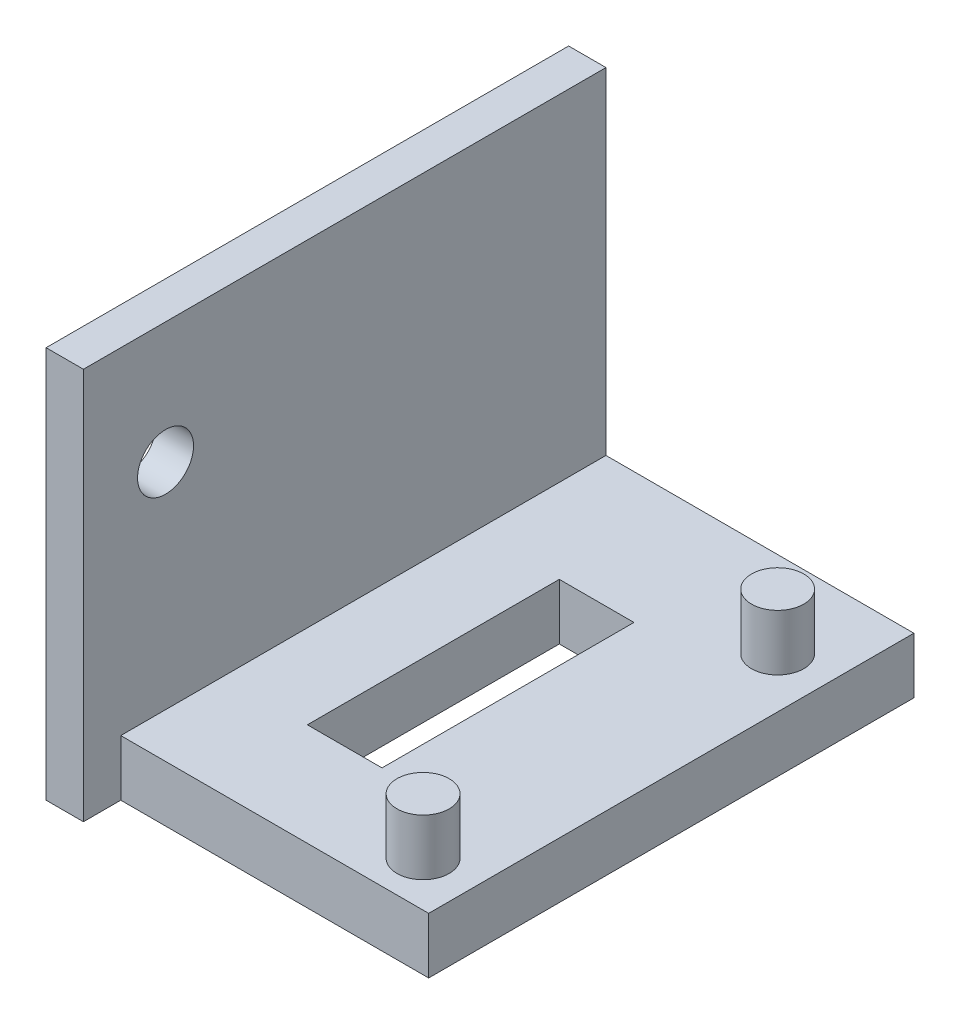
ISO-10303-21;
HEADER;
FILE_DESCRIPTION(('STEP AP214'),'2;1');
FILE_NAME('part.step','',(''),(''),'','','');
FILE_SCHEMA(('AUTOMOTIVE_DESIGN { 1 0 10303 214 1 1 1 1 }'));
ENDSEC;
DATA;
#1=APPLICATION_CONTEXT('core data for automotive mechanical design processes');
#2=APPLICATION_PROTOCOL_DEFINITION('international standard','automotive_design',2000,#1);
#3=PRODUCT_CONTEXT('',#1,'mechanical');
#4=PRODUCT('Part','Part','',(#3));
#5=PRODUCT_RELATED_PRODUCT_CATEGORY('part','',(#4));
#6=PRODUCT_DEFINITION_FORMATION('','',#4);
#7=PRODUCT_DEFINITION_CONTEXT('part definition',#1,'design');
#8=PRODUCT_DEFINITION('design','',#6,#7);
#9=PRODUCT_DEFINITION_SHAPE('','',#8);
#10=(LENGTH_UNIT() NAMED_UNIT(*) SI_UNIT(.MILLI.,.METRE.));
#11=(NAMED_UNIT(*) PLANE_ANGLE_UNIT() SI_UNIT($,.RADIAN.));
#12=(NAMED_UNIT(*) SI_UNIT($,.STERADIAN.) SOLID_ANGLE_UNIT());
#13=UNCERTAINTY_MEASURE_WITH_UNIT(LENGTH_MEASURE(1.E-05),#10,'distance_accuracy_value','');
#14=(GEOMETRIC_REPRESENTATION_CONTEXT(3) GLOBAL_UNCERTAINTY_ASSIGNED_CONTEXT((#13)) GLOBAL_UNIT_ASSIGNED_CONTEXT((#10,
#11,#12)) REPRESENTATION_CONTEXT('',''));
#15=CARTESIAN_POINT('',(0.,0.,0.));
#16=DIRECTION('',(0.,0.,1.));
#17=DIRECTION('',(1.,0.,0.));
#18=AXIS2_PLACEMENT_3D('',#15,#16,#17);
#19=CARTESIAN_POINT('',(8.25,-3.,-13.));
#20=DIRECTION('',(1.,0.,0.));
#21=DIRECTION('',(0.,0.,-1.));
#22=AXIS2_PLACEMENT_3D('',#19,#20,#21);
#23=PLANE('',#22);
#24=DIRECTION('',(0.,0.,-1.));
#25=VECTOR('',#24,1.);
#26=CARTESIAN_POINT('',(8.25,0.,-13.));
#27=LINE('',#26,#25);
#28=CARTESIAN_POINT('',(8.25,0.,13.));
#29=VERTEX_POINT('',#28);
#30=CARTESIAN_POINT('',(8.25,0.,-13.));
#31=VERTEX_POINT('',#30);
#32=EDGE_CURVE('E226',#29,#31,#27,.T.);
#33=ORIENTED_EDGE('',*,*,#32,.F.);
#34=DIRECTION('',(0.,1.,0.));
#35=VECTOR('',#34,1.);
#36=CARTESIAN_POINT('',(8.25,-3.,13.));
#37=LINE('',#36,#35);
#38=CARTESIAN_POINT('',(8.25,-3.,13.));
#39=VERTEX_POINT('',#38);
#40=EDGE_CURVE('E11',#39,#29,#37,.T.);
#41=ORIENTED_EDGE('',*,*,#40,.F.);
#42=DIRECTION('',(0.,0.,-1.));
#43=VECTOR('',#42,1.);
#44=CARTESIAN_POINT('',(8.25,-3.,-13.));
#45=LINE('',#44,#43);
#46=CARTESIAN_POINT('',(8.25,-3.,-13.));
#47=VERTEX_POINT('',#46);
#48=EDGE_CURVE('E235',#39,#47,#45,.T.);
#49=ORIENTED_EDGE('',*,*,#48,.T.);
#50=DIRECTION('',(0.,1.,0.));
#51=VECTOR('',#50,1.);
#52=CARTESIAN_POINT('',(8.25,-3.,-13.));
#53=LINE('',#52,#51);
#54=EDGE_CURVE('E247',#47,#31,#53,.T.);
#55=ORIENTED_EDGE('',*,*,#54,.T.);
#56=EDGE_LOOP('',(#33,#41,#49,#55));
#57=FACE_BOUND('',#56,.T.);
#58=ADVANCED_FACE('F39',(#57),#23,.T.);
#59=CARTESIAN_POINT('',(-8.25,-3.,13.));
#60=DIRECTION('',(0.,0.,1.));
#61=DIRECTION('',(1.,0.,0.));
#62=AXIS2_PLACEMENT_3D('',#59,#60,#61);
#63=PLANE('',#62);
#64=DIRECTION('',(1.,0.,0.));
#65=VECTOR('',#64,1.);
#66=CARTESIAN_POINT('',(-8.25,0.,13.));
#67=LINE('',#66,#65);
#68=CARTESIAN_POINT('',(-8.25,0.,13.));
#69=VERTEX_POINT('',#68);
#70=EDGE_CURVE('E240',#69,#29,#67,.T.);
#71=ORIENTED_EDGE('',*,*,#70,.F.);
#72=DIRECTION('',(0.,1.,0.));
#73=VECTOR('',#72,1.);
#74=CARTESIAN_POINT('',(-8.25,-3.,13.));
#75=LINE('',#74,#73);
#76=CARTESIAN_POINT('',(-8.25,-3.,13.));
#77=VERTEX_POINT('',#76);
#78=EDGE_CURVE('E48',#77,#69,#75,.T.);
#79=ORIENTED_EDGE('',*,*,#78,.F.);
#80=DIRECTION('',(1.,0.,0.));
#81=VECTOR('',#80,1.);
#82=CARTESIAN_POINT('',(-8.25,-3.,13.));
#83=LINE('',#82,#81);
#84=EDGE_CURVE('E243',#77,#39,#83,.T.);
#85=ORIENTED_EDGE('',*,*,#84,.T.);
#86=ORIENTED_EDGE('',*,*,#40,.T.);
#87=EDGE_LOOP('',(#71,#79,#85,#86));
#88=FACE_BOUND('',#87,.T.);
#89=ADVANCED_FACE('F276',(#88),#63,.T.);
#90=CARTESIAN_POINT('',(-8.25,-3.,-13.));
#91=DIRECTION('',(0.,0.,-1.));
#92=DIRECTION('',(-1.,0.,0.));
#93=AXIS2_PLACEMENT_3D('',#90,#91,#92);
#94=PLANE('',#93);
#95=DIRECTION('',(-1.,0.,0.));
#96=VECTOR('',#95,1.);
#97=CARTESIAN_POINT('',(-8.25,0.,-13.));
#98=LINE('',#97,#96);
#99=CARTESIAN_POINT('',(-8.25,0.,-13.));
#100=VERTEX_POINT('',#99);
#101=EDGE_CURVE('E251',#31,#100,#98,.T.);
#102=ORIENTED_EDGE('',*,*,#101,.F.);
#103=ORIENTED_EDGE('',*,*,#54,.F.);
#104=DIRECTION('',(-1.,0.,0.));
#105=VECTOR('',#104,1.);
#106=CARTESIAN_POINT('',(-8.25,-3.,-13.));
#107=LINE('',#106,#105);
#108=CARTESIAN_POINT('',(-10.25,-3.,-13.));
#109=VERTEX_POINT('',#108);
#110=EDGE_CURVE('E239',#47,#109,#107,.T.);
#111=ORIENTED_EDGE('',*,*,#110,.T.);
#112=DIRECTION('',(0.,1.,0.));
#113=VECTOR('',#112,1.);
#114=CARTESIAN_POINT('',(-10.25,-3.,-13.));
#115=LINE('',#114,#113);
#116=CARTESIAN_POINT('',(-10.25,18.,-13.));
#117=VERTEX_POINT('',#116);
#118=EDGE_CURVE('E170',#109,#117,#115,.T.);
#119=ORIENTED_EDGE('',*,*,#118,.T.);
#120=DIRECTION('',(-1.,0.,0.));
#121=VECTOR('',#120,1.);
#122=CARTESIAN_POINT('',(-10.25,18.,-13.));
#123=LINE('',#122,#121);
#124=CARTESIAN_POINT('',(-8.25,18.,-13.));
#125=VERTEX_POINT('',#124);
#126=EDGE_CURVE('E150',#125,#117,#123,.T.);
#127=ORIENTED_EDGE('',*,*,#126,.F.);
#128=DIRECTION('',(0.,1.,0.));
#129=VECTOR('',#128,1.);
#130=CARTESIAN_POINT('',(-8.25,-3.,-13.));
#131=LINE('',#130,#129);
#132=EDGE_CURVE('E174',#100,#125,#131,.T.);
#133=ORIENTED_EDGE('',*,*,#132,.F.);
#134=EDGE_LOOP('',(#102,#103,#111,#119,#127,#133));
#135=FACE_BOUND('',#134,.T.);
#136=ADVANCED_FACE('F271',(#135),#94,.T.);
#137=CARTESIAN_POINT('',(0.,-3.,0.));
#138=DIRECTION('',(0.,1.,0.));
#139=DIRECTION('',(0.,0.,1.));
#140=AXIS2_PLACEMENT_3D('',#137,#138,#139);
#141=PLANE('',#140);
#142=DIRECTION('',(1.,0.,0.));
#143=VECTOR('',#142,1.);
#144=CARTESIAN_POINT('',(-3.75,-3.,7.5));
#145=LINE('',#144,#143);
#146=CARTESIAN_POINT('',(-3.75,-3.,7.5));
#147=VERTEX_POINT('',#146);
#148=CARTESIAN_POINT('',(0.249999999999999,-3.,7.5));
#149=VERTEX_POINT('',#148);
#150=EDGE_CURVE('E205',#147,#149,#145,.T.);
#151=ORIENTED_EDGE('',*,*,#150,.T.);
#152=DIRECTION('',(0.,0.,-1.));
#153=VECTOR('',#152,1.);
#154=CARTESIAN_POINT('',(0.249999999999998,-3.,-6.));
#155=LINE('',#154,#153);
#156=CARTESIAN_POINT('',(0.249999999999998,-3.,-6.));
#157=VERTEX_POINT('',#156);
#158=EDGE_CURVE('E194',#149,#157,#155,.T.);
#159=ORIENTED_EDGE('',*,*,#158,.T.);
#160=DIRECTION('',(-1.,0.,0.));
#161=VECTOR('',#160,1.);
#162=CARTESIAN_POINT('',(-3.75,-3.,-6.));
#163=LINE('',#162,#161);
#164=CARTESIAN_POINT('',(-3.75,-3.,-6.));
#165=VERTEX_POINT('',#164);
#166=EDGE_CURVE('E198',#157,#165,#163,.T.);
#167=ORIENTED_EDGE('',*,*,#166,.T.);
#168=DIRECTION('',(0.,0.,1.));
#169=VECTOR('',#168,1.);
#170=CARTESIAN_POINT('',(-3.75,-3.,-6.));
#171=LINE('',#170,#169);
#172=EDGE_CURVE('E56',#165,#147,#171,.T.);
#173=ORIENTED_EDGE('',*,*,#172,.T.);
#174=EDGE_LOOP('',(#151,#159,#167,#173));
#175=FACE_BOUND('',#174,.T.);
#176=ORIENTED_EDGE('',*,*,#48,.F.);
#177=ORIENTED_EDGE('',*,*,#84,.F.);
#178=DIRECTION('',(0.,0.,-1.));
#179=VECTOR('',#178,1.);
#180=CARTESIAN_POINT('',(-8.25,-3.,-13.));
#181=LINE('',#180,#179);
#182=CARTESIAN_POINT('',(-8.25,-3.,15.));
#183=VERTEX_POINT('',#182);
#184=EDGE_CURVE('E136',#183,#77,#181,.T.);
#185=ORIENTED_EDGE('',*,*,#184,.F.);
#186=DIRECTION('',(1.,0.,0.));
#187=VECTOR('',#186,1.);
#188=CARTESIAN_POINT('',(-10.25,-3.,15.));
#189=LINE('',#188,#187);
#190=CARTESIAN_POINT('',(-10.25,-3.,15.));
#191=VERTEX_POINT('',#190);
#192=EDGE_CURVE('E164',#191,#183,#189,.T.);
#193=ORIENTED_EDGE('',*,*,#192,.F.);
#194=DIRECTION('',(0.,0.,1.));
#195=VECTOR('',#194,1.);
#196=CARTESIAN_POINT('',(-10.25,-3.,-13.));
#197=LINE('',#196,#195);
#198=EDGE_CURVE('E130',#109,#191,#197,.T.);
#199=ORIENTED_EDGE('',*,*,#198,.F.);
#200=ORIENTED_EDGE('',*,*,#110,.F.);
#201=EDGE_LOOP('',(#176,#177,#185,#193,#199,#200));
#202=FACE_BOUND('',#201,.T.);
#203=ADVANCED_FACE('F279',(#175,#202),#141,.F.);
#204=CARTESIAN_POINT('',(0.,0.,0.));
#205=DIRECTION('',(0.,1.,0.));
#206=DIRECTION('',(0.,0.,1.));
#207=AXIS2_PLACEMENT_3D('',#204,#205,#206);
#208=PLANE('',#207);
#209=CARTESIAN_POINT('',(5.55,0.,10.6));
#210=DIRECTION('',(0.,1.,0.));
#211=DIRECTION('',(0.,0.,1.));
#212=AXIS2_PLACEMENT_3D('',#209,#210,#211);
#213=CIRCLE('',#212,1.4);
#214=CARTESIAN_POINT('',(5.55,0.,12.));
#215=VERTEX_POINT('',#214);
#216=EDGE_CURVE('E173',#215,#215,#213,.T.);
#217=ORIENTED_EDGE('',*,*,#216,.F.);
#218=EDGE_LOOP('',(#217));
#219=FACE_BOUND('',#218,.T.);
#220=CARTESIAN_POINT('',(5.55,0.,-8.4));
#221=DIRECTION('',(0.,1.,0.));
#222=DIRECTION('',(0.,0.,1.));
#223=AXIS2_PLACEMENT_3D('',#220,#221,#222);
#224=CIRCLE('',#223,1.4);
#225=CARTESIAN_POINT('',(5.55,0.,-6.99999999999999));
#226=VERTEX_POINT('',#225);
#227=EDGE_CURVE('E183',#226,#226,#224,.T.);
#228=ORIENTED_EDGE('',*,*,#227,.F.);
#229=EDGE_LOOP('',(#228));
#230=FACE_BOUND('',#229,.T.);
#231=DIRECTION('',(0.,0.,-1.));
#232=VECTOR('',#231,1.);
#233=CARTESIAN_POINT('',(0.249999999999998,0.,-6.));
#234=LINE('',#233,#232);
#235=CARTESIAN_POINT('',(0.249999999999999,0.,7.5));
#236=VERTEX_POINT('',#235);
#237=CARTESIAN_POINT('',(0.249999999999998,0.,-6.));
#238=VERTEX_POINT('',#237);
#239=EDGE_CURVE('E64',#236,#238,#234,.T.);
#240=ORIENTED_EDGE('',*,*,#239,.F.);
#241=DIRECTION('',(1.,0.,0.));
#242=VECTOR('',#241,1.);
#243=CARTESIAN_POINT('',(-3.75,0.,7.5));
#244=LINE('',#243,#242);
#245=CARTESIAN_POINT('',(-3.75,0.,7.5));
#246=VERTEX_POINT('',#245);
#247=EDGE_CURVE('E199',#246,#236,#244,.T.);
#248=ORIENTED_EDGE('',*,*,#247,.F.);
#249=DIRECTION('',(0.,0.,1.));
#250=VECTOR('',#249,1.);
#251=CARTESIAN_POINT('',(-3.75,0.,-6.));
#252=LINE('',#251,#250);
#253=CARTESIAN_POINT('',(-3.75,0.,-6.));
#254=VERTEX_POINT('',#253);
#255=EDGE_CURVE('E216',#254,#246,#252,.T.);
#256=ORIENTED_EDGE('',*,*,#255,.F.);
#257=DIRECTION('',(-1.,0.,0.));
#258=VECTOR('',#257,1.);
#259=CARTESIAN_POINT('',(-3.75,0.,-6.));
#260=LINE('',#259,#258);
#261=EDGE_CURVE('E212',#238,#254,#260,.T.);
#262=ORIENTED_EDGE('',*,*,#261,.F.);
#263=EDGE_LOOP('',(#240,#248,#256,#262));
#264=FACE_BOUND('',#263,.T.);
#265=ORIENTED_EDGE('',*,*,#32,.T.);
#266=ORIENTED_EDGE('',*,*,#101,.T.);
#267=DIRECTION('',(0.,0.,1.));
#268=VECTOR('',#267,1.);
#269=CARTESIAN_POINT('',(-8.25,0.,-13.));
#270=LINE('',#269,#268);
#271=EDGE_CURVE('E254',#100,#69,#270,.T.);
#272=ORIENTED_EDGE('',*,*,#271,.T.);
#273=ORIENTED_EDGE('',*,*,#70,.T.);
#274=EDGE_LOOP('',(#265,#266,#272,#273));
#275=FACE_BOUND('',#274,.T.);
#276=ADVANCED_FACE('F274',(#219,#230,#264,#275),#208,.T.);
#277=CARTESIAN_POINT('',(0.249999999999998,-3.,-6.));
#278=DIRECTION('',(1.,0.,0.));
#279=DIRECTION('',(0.,0.,-1.));
#280=AXIS2_PLACEMENT_3D('',#277,#278,#279);
#281=PLANE('',#280);
#282=ORIENTED_EDGE('',*,*,#239,.T.);
#283=DIRECTION('',(0.,1.,0.));
#284=VECTOR('',#283,1.);
#285=CARTESIAN_POINT('',(0.249999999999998,-3.,-6.));
#286=LINE('',#285,#284);
#287=EDGE_CURVE('E209',#157,#238,#286,.T.);
#288=ORIENTED_EDGE('',*,*,#287,.F.);
#289=ORIENTED_EDGE('',*,*,#158,.F.);
#290=DIRECTION('',(0.,1.,0.));
#291=VECTOR('',#290,1.);
#292=CARTESIAN_POINT('',(0.249999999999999,-3.,7.5));
#293=LINE('',#292,#291);
#294=EDGE_CURVE('E223',#149,#236,#293,.T.);
#295=ORIENTED_EDGE('',*,*,#294,.T.);
#296=EDGE_LOOP('',(#282,#288,#289,#295));
#297=FACE_BOUND('',#296,.T.);
#298=ADVANCED_FACE('F310',(#297),#281,.F.);
#299=CARTESIAN_POINT('',(-3.75,-3.,7.5));
#300=DIRECTION('',(0.,0.,1.));
#301=DIRECTION('',(1.,0.,0.));
#302=AXIS2_PLACEMENT_3D('',#299,#300,#301);
#303=PLANE('',#302);
#304=ORIENTED_EDGE('',*,*,#247,.T.);
#305=ORIENTED_EDGE('',*,*,#294,.F.);
#306=ORIENTED_EDGE('',*,*,#150,.F.);
#307=DIRECTION('',(0.,1.,0.));
#308=VECTOR('',#307,1.);
#309=CARTESIAN_POINT('',(-3.75,-3.,7.5));
#310=LINE('',#309,#308);
#311=EDGE_CURVE('E227',#147,#246,#310,.T.);
#312=ORIENTED_EDGE('',*,*,#311,.T.);
#313=EDGE_LOOP('',(#304,#305,#306,#312));
#314=FACE_BOUND('',#313,.T.);
#315=ADVANCED_FACE('F317',(#314),#303,.F.);
#316=CARTESIAN_POINT('',(-3.75,-3.,-6.));
#317=DIRECTION('',(-1.,0.,0.));
#318=DIRECTION('',(0.,0.,1.));
#319=AXIS2_PLACEMENT_3D('',#316,#317,#318);
#320=PLANE('',#319);
#321=ORIENTED_EDGE('',*,*,#255,.T.);
#322=ORIENTED_EDGE('',*,*,#311,.F.);
#323=ORIENTED_EDGE('',*,*,#172,.F.);
#324=DIRECTION('',(0.,1.,0.));
#325=VECTOR('',#324,1.);
#326=CARTESIAN_POINT('',(-3.75,-3.,-6.));
#327=LINE('',#326,#325);
#328=EDGE_CURVE('E230',#165,#254,#327,.T.);
#329=ORIENTED_EDGE('',*,*,#328,.T.);
#330=EDGE_LOOP('',(#321,#322,#323,#329));
#331=FACE_BOUND('',#330,.T.);
#332=ADVANCED_FACE('F322',(#331),#320,.F.);
#333=CARTESIAN_POINT('',(-3.75,-3.,-6.));
#334=DIRECTION('',(0.,0.,-1.));
#335=DIRECTION('',(-1.,0.,0.));
#336=AXIS2_PLACEMENT_3D('',#333,#334,#335);
#337=PLANE('',#336);
#338=ORIENTED_EDGE('',*,*,#261,.T.);
#339=ORIENTED_EDGE('',*,*,#328,.F.);
#340=ORIENTED_EDGE('',*,*,#166,.F.);
#341=ORIENTED_EDGE('',*,*,#287,.T.);
#342=EDGE_LOOP('',(#338,#339,#340,#341));
#343=FACE_BOUND('',#342,.T.);
#344=ADVANCED_FACE('F318',(#343),#337,.F.);
#345=CARTESIAN_POINT('',(5.55,3.,-8.4));
#346=DIRECTION('',(0.,-1.,0.));
#347=DIRECTION('',(0.,0.,-1.));
#348=AXIS2_PLACEMENT_3D('',#345,#346,#347);
#349=CYLINDRICAL_SURFACE('',#348,1.4);
#350=CARTESIAN_POINT('',(5.55,3.,-8.4));
#351=DIRECTION('',(0.,1.,0.));
#352=DIRECTION('',(0.,0.,1.));
#353=AXIS2_PLACEMENT_3D('',#350,#351,#352);
#354=CIRCLE('',#353,1.4);
#355=CARTESIAN_POINT('',(5.55,3.,-6.99999999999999));
#356=VERTEX_POINT('',#355);
#357=EDGE_CURVE('E187',#356,#356,#354,.T.);
#358=ORIENTED_EDGE('',*,*,#357,.F.);
#359=EDGE_LOOP('',(#358));
#360=FACE_BOUND('',#359,.T.);
#361=ORIENTED_EDGE('',*,*,#227,.T.);
#362=EDGE_LOOP('',(#361));
#363=FACE_BOUND('',#362,.T.);
#364=ADVANCED_FACE('F321',(#360,#363),#349,.T.);
#365=CARTESIAN_POINT('',(5.55,3.,-8.4));
#366=DIRECTION('',(0.,1.,0.));
#367=DIRECTION('',(0.,0.,1.));
#368=AXIS2_PLACEMENT_3D('',#365,#366,#367);
#369=PLANE('',#368);
#370=ORIENTED_EDGE('',*,*,#357,.T.);
#371=EDGE_LOOP('',(#370));
#372=FACE_BOUND('',#371,.T.);
#373=ADVANCED_FACE('F331',(#372),#369,.T.);
#374=CARTESIAN_POINT('',(5.55,3.,10.6));
#375=DIRECTION('',(0.,-1.,0.));
#376=DIRECTION('',(0.,0.,-1.));
#377=AXIS2_PLACEMENT_3D('',#374,#375,#376);
#378=CYLINDRICAL_SURFACE('',#377,1.4);
#379=CARTESIAN_POINT('',(5.55,3.,10.6));
#380=DIRECTION('',(0.,1.,0.));
#381=DIRECTION('',(0.,0.,1.));
#382=AXIS2_PLACEMENT_3D('',#379,#380,#381);
#383=CIRCLE('',#382,1.4);
#384=CARTESIAN_POINT('',(5.55,3.,12.));
#385=VERTEX_POINT('',#384);
#386=EDGE_CURVE('E179',#385,#385,#383,.T.);
#387=ORIENTED_EDGE('',*,*,#386,.F.);
#388=EDGE_LOOP('',(#387));
#389=FACE_BOUND('',#388,.T.);
#390=ORIENTED_EDGE('',*,*,#216,.T.);
#391=EDGE_LOOP('',(#390));
#392=FACE_BOUND('',#391,.T.);
#393=ADVANCED_FACE('F293',(#389,#392),#378,.T.);
#394=CARTESIAN_POINT('',(5.55,3.,10.6));
#395=DIRECTION('',(0.,1.,0.));
#396=DIRECTION('',(0.,0.,1.));
#397=AXIS2_PLACEMENT_3D('',#394,#395,#396);
#398=PLANE('',#397);
#399=ORIENTED_EDGE('',*,*,#386,.T.);
#400=EDGE_LOOP('',(#399));
#401=FACE_BOUND('',#400,.T.);
#402=ADVANCED_FACE('F284',(#401),#398,.T.);
#403=CARTESIAN_POINT('',(-8.25,-3.,-13.));
#404=DIRECTION('',(1.,0.,0.));
#405=DIRECTION('',(0.,0.,-1.));
#406=AXIS2_PLACEMENT_3D('',#403,#404,#405);
#407=PLANE('',#406);
#408=CARTESIAN_POINT('',(-8.25,11.5,10.6));
#409=DIRECTION('',(1.,0.,0.));
#410=DIRECTION('',(0.,0.,-1.));
#411=AXIS2_PLACEMENT_3D('',#408,#409,#410);
#412=CIRCLE('',#411,1.5);
#413=CARTESIAN_POINT('',(-8.25,11.5,9.1));
#414=VERTEX_POINT('',#413);
#415=EDGE_CURVE('E152',#414,#414,#412,.T.);
#416=ORIENTED_EDGE('',*,*,#415,.F.);
#417=EDGE_LOOP('',(#416));
#418=FACE_BOUND('',#417,.T.);
#419=ORIENTED_EDGE('',*,*,#271,.F.);
#420=ORIENTED_EDGE('',*,*,#132,.T.);
#421=DIRECTION('',(0.,0.,-1.));
#422=VECTOR('',#421,1.);
#423=CARTESIAN_POINT('',(-8.25,18.,-13.));
#424=LINE('',#423,#422);
#425=CARTESIAN_POINT('',(-8.25,18.,15.));
#426=VERTEX_POINT('',#425);
#427=EDGE_CURVE('E145',#426,#125,#424,.T.);
#428=ORIENTED_EDGE('',*,*,#427,.F.);
#429=DIRECTION('',(0.,1.,0.));
#430=VECTOR('',#429,1.);
#431=CARTESIAN_POINT('',(-8.25,-3.,15.));
#432=LINE('',#431,#430);
#433=EDGE_CURVE('E135',#183,#426,#432,.T.);
#434=ORIENTED_EDGE('',*,*,#433,.F.);
#435=ORIENTED_EDGE('',*,*,#184,.T.);
#436=ORIENTED_EDGE('',*,*,#78,.T.);
#437=EDGE_LOOP('',(#419,#420,#428,#434,#435,#436));
#438=FACE_BOUND('',#437,.T.);
#439=ADVANCED_FACE('F282',(#418,#438),#407,.T.);
#440=CARTESIAN_POINT('',(-10.25,-3.,-13.));
#441=DIRECTION('',(-1.,0.,0.));
#442=DIRECTION('',(0.,0.,1.));
#443=AXIS2_PLACEMENT_3D('',#440,#441,#442);
#444=PLANE('',#443);
#445=CARTESIAN_POINT('',(-10.25,11.5,10.6));
#446=DIRECTION('',(-1.,0.,0.));
#447=DIRECTION('',(0.,0.,1.));
#448=AXIS2_PLACEMENT_3D('',#445,#446,#447);
#449=CIRCLE('',#448,1.5);
#450=CARTESIAN_POINT('',(-10.25,11.5,12.1));
#451=VERTEX_POINT('',#450);
#452=EDGE_CURVE('E42',#451,#451,#449,.T.);
#453=ORIENTED_EDGE('',*,*,#452,.F.);
#454=EDGE_LOOP('',(#453));
#455=FACE_BOUND('',#454,.T.);
#456=DIRECTION('',(0.,1.,0.));
#457=VECTOR('',#456,1.);
#458=CARTESIAN_POINT('',(-10.25,-3.,15.));
#459=LINE('',#458,#457);
#460=CARTESIAN_POINT('',(-10.25,18.,15.));
#461=VERTEX_POINT('',#460);
#462=EDGE_CURVE('E123',#191,#461,#459,.T.);
#463=ORIENTED_EDGE('',*,*,#462,.T.);
#464=DIRECTION('',(0.,0.,1.));
#465=VECTOR('',#464,1.);
#466=CARTESIAN_POINT('',(-10.25,18.,-13.));
#467=LINE('',#466,#465);
#468=EDGE_CURVE('E128',#117,#461,#467,.T.);
#469=ORIENTED_EDGE('',*,*,#468,.F.);
#470=ORIENTED_EDGE('',*,*,#118,.F.);
#471=ORIENTED_EDGE('',*,*,#198,.T.);
#472=EDGE_LOOP('',(#463,#469,#470,#471));
#473=FACE_BOUND('',#472,.T.);
#474=ADVANCED_FACE('F125',(#455,#473),#444,.T.);
#475=CARTESIAN_POINT('',(-10.25,-3.,15.));
#476=DIRECTION('',(0.,0.,1.));
#477=DIRECTION('',(1.,0.,0.));
#478=AXIS2_PLACEMENT_3D('',#475,#476,#477);
#479=PLANE('',#478);
#480=ORIENTED_EDGE('',*,*,#433,.T.);
#481=DIRECTION('',(1.,0.,0.));
#482=VECTOR('',#481,1.);
#483=CARTESIAN_POINT('',(-10.25,18.,15.));
#484=LINE('',#483,#482);
#485=EDGE_CURVE('E139',#461,#426,#484,.T.);
#486=ORIENTED_EDGE('',*,*,#485,.F.);
#487=ORIENTED_EDGE('',*,*,#462,.F.);
#488=ORIENTED_EDGE('',*,*,#192,.T.);
#489=EDGE_LOOP('',(#480,#486,#487,#488));
#490=FACE_BOUND('',#489,.T.);
#491=ADVANCED_FACE('F140',(#490),#479,.T.);
#492=CARTESIAN_POINT('',(0.,18.,0.));
#493=DIRECTION('',(0.,1.,0.));
#494=DIRECTION('',(0.,0.,1.));
#495=AXIS2_PLACEMENT_3D('',#492,#493,#494);
#496=PLANE('',#495);
#497=ORIENTED_EDGE('',*,*,#468,.T.);
#498=ORIENTED_EDGE('',*,*,#485,.T.);
#499=ORIENTED_EDGE('',*,*,#427,.T.);
#500=ORIENTED_EDGE('',*,*,#126,.T.);
#501=EDGE_LOOP('',(#497,#498,#499,#500));
#502=FACE_BOUND('',#501,.T.);
#503=ADVANCED_FACE('F148',(#502),#496,.T.);
#504=CARTESIAN_POINT('',(-18.,11.5,10.6));
#505=DIRECTION('',(1.,0.,0.));
#506=DIRECTION('',(0.,0.,-1.));
#507=AXIS2_PLACEMENT_3D('',#504,#505,#506);
#508=CYLINDRICAL_SURFACE('',#507,1.5);
#509=ORIENTED_EDGE('',*,*,#415,.T.);
#510=EDGE_LOOP('',(#509));
#511=FACE_BOUND('',#510,.T.);
#512=ORIENTED_EDGE('',*,*,#452,.T.);
#513=EDGE_LOOP('',(#512));
#514=FACE_BOUND('',#513,.T.);
#515=ADVANCED_FACE('F342',(#511,#514),#508,.F.);
#516=CLOSED_SHELL('',(#58,#89,#136,#203,#276,#298,#315,#332,#344,#364,#373,#393,#402,#439,#474,
#491,#503,#515));
#517=MANIFOLD_SOLID_BREP('B2',#516);
#518=ADVANCED_BREP_SHAPE_REPRESENTATION('',(#18,#517),#14);
#519=SHAPE_DEFINITION_REPRESENTATION(#9,#518);
ENDSEC;
END-ISO-10303-21;
